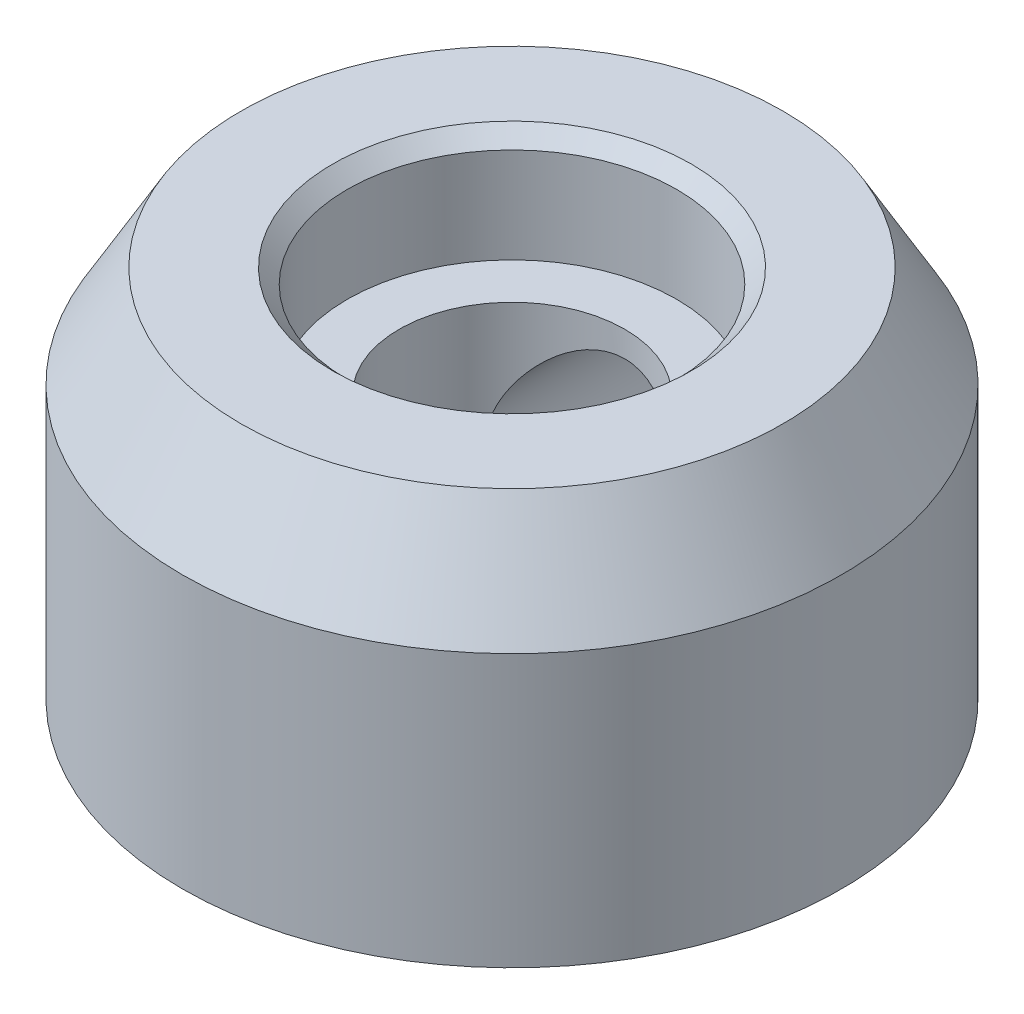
ISO-10303-21;
HEADER;
FILE_DESCRIPTION(('STEP AP214'),'2;1');
FILE_NAME('part.step','',(''),(''),'','','');
FILE_SCHEMA(('AUTOMOTIVE_DESIGN { 1 0 10303 214 1 1 1 1 }'));
ENDSEC;
DATA;
#1=APPLICATION_CONTEXT('core data for automotive mechanical design processes');
#2=APPLICATION_PROTOCOL_DEFINITION('international standard','automotive_design',2000,#1);
#3=PRODUCT_CONTEXT('',#1,'mechanical');
#4=PRODUCT('Part','Part','',(#3));
#5=PRODUCT_RELATED_PRODUCT_CATEGORY('part','',(#4));
#6=PRODUCT_DEFINITION_FORMATION('','',#4);
#7=PRODUCT_DEFINITION_CONTEXT('part definition',#1,'design');
#8=PRODUCT_DEFINITION('design','',#6,#7);
#9=PRODUCT_DEFINITION_SHAPE('','',#8);
#10=(LENGTH_UNIT() NAMED_UNIT(*) SI_UNIT(.MILLI.,.METRE.));
#11=(NAMED_UNIT(*) PLANE_ANGLE_UNIT() SI_UNIT($,.RADIAN.));
#12=(NAMED_UNIT(*) SI_UNIT($,.STERADIAN.) SOLID_ANGLE_UNIT());
#13=UNCERTAINTY_MEASURE_WITH_UNIT(LENGTH_MEASURE(1.E-05),#10,'distance_accuracy_value','');
#14=(GEOMETRIC_REPRESENTATION_CONTEXT(3) GLOBAL_UNCERTAINTY_ASSIGNED_CONTEXT((#13)) GLOBAL_UNIT_ASSIGNED_CONTEXT((#10,
#11,#12)) REPRESENTATION_CONTEXT('',''));
#15=CARTESIAN_POINT('',(0.,0.,0.));
#16=DIRECTION('',(0.,0.,1.));
#17=DIRECTION('',(1.,0.,0.));
#18=AXIS2_PLACEMENT_3D('',#15,#16,#17);
#19=CARTESIAN_POINT('',(0.,0.,0.));
#20=DIRECTION('',(0.,-1.,0.));
#21=DIRECTION('',(0.,0.,-1.));
#22=AXIS2_PLACEMENT_3D('',#19,#20,#21);
#23=CYLINDRICAL_SURFACE('',#22,7.1374);
#24=CARTESIAN_POINT('',(0.,16.8275,0.));
#25=DIRECTION('',(0.,1.,0.));
#26=DIRECTION('',(0.,0.,1.));
#27=AXIS2_PLACEMENT_3D('',#24,#25,#26);
#28=CIRCLE('',#27,7.1374);
#29=CARTESIAN_POINT('',(0.,16.8275,7.1374));
#30=VERTEX_POINT('',#29);
#31=EDGE_CURVE('E40',#30,#30,#28,.T.);
#32=ORIENTED_EDGE('',*,*,#31,.T.);
#33=EDGE_LOOP('',(#32));
#34=FACE_BOUND('',#33,.T.);
#35=CARTESIAN_POINT('',(0.,12.7,0.));
#36=DIRECTION('',(0.,-1.,0.));
#37=DIRECTION('',(0.,0.,-1.));
#38=AXIS2_PLACEMENT_3D('',#35,#36,#37);
#39=CIRCLE('',#38,7.1374);
#40=CARTESIAN_POINT('',(0.,12.7,-7.1374));
#41=VERTEX_POINT('',#40);
#42=EDGE_CURVE('E56',#41,#41,#39,.T.);
#43=ORIENTED_EDGE('',*,*,#42,.T.);
#44=EDGE_LOOP('',(#43));
#45=FACE_BOUND('',#44,.T.);
#46=ADVANCED_FACE('F30',(#34,#45),#23,.F.);
#47=CARTESIAN_POINT('',(4.8895,12.7,0.));
#48=DIRECTION('',(0.,1.,0.));
#49=DIRECTION('',(0.,0.,1.));
#50=AXIS2_PLACEMENT_3D('',#47,#48,#49);
#51=PLANE('',#50);
#52=CARTESIAN_POINT('',(0.,12.7,0.));
#53=DIRECTION('',(0.,-1.,0.));
#54=DIRECTION('',(0.,0.,-1.));
#55=AXIS2_PLACEMENT_3D('',#52,#53,#54);
#56=CIRCLE('',#55,4.8895);
#57=CARTESIAN_POINT('',(0.,12.7,-4.8895));
#58=VERTEX_POINT('',#57);
#59=EDGE_CURVE('E97',#58,#58,#56,.T.);
#60=ORIENTED_EDGE('',*,*,#59,.T.);
#61=EDGE_LOOP('',(#60));
#62=FACE_BOUND('',#61,.T.);
#63=ORIENTED_EDGE('',*,*,#42,.F.);
#64=EDGE_LOOP('',(#63));
#65=FACE_BOUND('',#64,.T.);
#66=ADVANCED_FACE('F85',(#62,#65),#51,.T.);
#67=CARTESIAN_POINT('',(0.,0.,0.));
#68=DIRECTION('',(0.,-1.,0.));
#69=DIRECTION('',(0.,0.,-1.));
#70=AXIS2_PLACEMENT_3D('',#67,#68,#69);
#71=CYLINDRICAL_SURFACE('',#70,4.8895);
#72=CARTESIAN_POINT('',(0.,11.58875,-4.8895));
#73=CARTESIAN_POINT('',(-0.0949550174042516,11.5887504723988,-4.88950046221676));
#74=CARTESIAN_POINT('',(-0.189904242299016,11.5853370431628,-4.88672853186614));
#75=CARTESIAN_POINT('',(-0.379031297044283,11.5717469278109,-4.87570729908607));
#76=CARTESIAN_POINT('',(-0.473208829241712,11.561567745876,-4.86745597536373));
#77=CARTESIAN_POINT('',(-0.660097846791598,11.5346095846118,-4.845651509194));
#78=CARTESIAN_POINT('',(-0.752807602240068,11.5178233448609,-4.83209253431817));
#79=CARTESIAN_POINT('',(-0.935992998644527,11.4779395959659,-4.79997855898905));
#80=CARTESIAN_POINT('',(-1.02646761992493,11.4548392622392,-4.78142132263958));
#81=CARTESIAN_POINT('',(-1.29242221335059,11.3769297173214,-4.71908577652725));
#82=CARTESIAN_POINT('',(-1.46381871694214,11.3133046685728,-4.66847341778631));
#83=CARTESIAN_POINT('',(-1.79205793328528,11.1656989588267,-4.55259529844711));
#84=CARTESIAN_POINT('',(-1.94889835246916,11.0817150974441,-4.48732723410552));
#85=CARTESIAN_POINT('',(-2.19854874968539,10.9262804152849,-4.36876211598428));
#86=CARTESIAN_POINT('',(-2.29572294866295,10.8594924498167,-4.31837093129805));
#87=CARTESIAN_POINT('',(-2.48249039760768,10.718692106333,-4.2137752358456));
#88=CARTESIAN_POINT('',(-2.57208362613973,10.6446797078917,-4.15957071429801));
#89=CARTESIAN_POINT('',(-2.74381452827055,10.4898205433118,-4.04835642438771));
#90=CARTESIAN_POINT('',(-2.82592982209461,10.4089545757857,-3.99133897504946));
#91=CARTESIAN_POINT('',(-2.98234386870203,10.2410235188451,-3.87585860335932));
#92=CARTESIAN_POINT('',(-3.05664557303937,10.1539607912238,-3.81739623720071));
#93=CARTESIAN_POINT('',(-3.19859878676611,9.97232900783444,-3.69930259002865));
#94=CARTESIAN_POINT('',(-3.26611802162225,9.8776586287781,-3.63966813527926));
#95=CARTESIAN_POINT('',(-3.39295924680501,9.68213259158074,-3.5217235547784));
#96=CARTESIAN_POINT('',(-3.45227856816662,9.58127493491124,-3.46341386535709));
#97=CARTESIAN_POINT('',(-3.56227954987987,9.37354413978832,-3.35016195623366));
#98=CARTESIAN_POINT('',(-3.61298363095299,9.26668760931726,-3.2952112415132));
#99=CARTESIAN_POINT('',(-3.70539881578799,9.04661430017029,-3.19093702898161));
#100=CARTESIAN_POINT('',(-3.74711765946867,8.9334031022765,-3.14160870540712));
#101=CARTESIAN_POINT('',(-3.82558637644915,8.68531654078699,-3.0457211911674));
#102=CARTESIAN_POINT('',(-3.86099214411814,8.54953472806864,-3.00034882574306));
#103=CARTESIAN_POINT('',(-3.91758843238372,8.2708420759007,-2.92607716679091));
#104=CARTESIAN_POINT('',(-3.93881438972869,8.12794997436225,-2.89713683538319));
#105=CARTESIAN_POINT('',(-3.9655664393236,7.83639148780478,-2.8604326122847));
#106=CARTESIAN_POINT('',(-3.97093606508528,7.68768213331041,-2.85287979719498));
#107=CARTESIAN_POINT('',(-3.96492918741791,7.39123096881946,-2.86121537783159));
#108=CARTESIAN_POINT('',(-3.95354213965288,7.24348982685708,-2.87711853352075));
#109=CARTESIAN_POINT('',(-3.91260813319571,6.93444331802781,-2.93257383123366));
#110=CARTESIAN_POINT('',(-3.88082697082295,6.7739822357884,-2.97501610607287));
#111=CARTESIAN_POINT('',(-3.79987132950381,6.46332439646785,-3.07772825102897));
#112=CARTESIAN_POINT('',(-3.75064331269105,6.31316095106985,-3.13805290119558));
#113=CARTESIAN_POINT('',(-3.6503749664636,6.05800805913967,-3.25367391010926));
#114=CARTESIAN_POINT('',(-3.60250841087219,5.95072543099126,-3.3067931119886));
#115=CARTESIAN_POINT('',(-3.49837763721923,5.74225841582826,-3.41676683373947));
#116=CARTESIAN_POINT('',(-3.44210918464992,5.64107714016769,-3.47362322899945));
#117=CARTESIAN_POINT('',(-3.32144008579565,5.44461093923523,-3.5891837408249));
#118=CARTESIAN_POINT('',(-3.25702941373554,5.34933350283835,-3.64789006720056));
#119=CARTESIAN_POINT('',(-3.12029236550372,5.16481491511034,-3.76551724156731));
#120=CARTESIAN_POINT('',(-3.0479673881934,5.07557270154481,-3.82443804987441));
#121=CARTESIAN_POINT('',(-2.8928398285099,4.90032896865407,-3.94316527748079));
#122=CARTESIAN_POINT('',(-2.80976323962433,4.81454311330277,-4.00293291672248));
#123=CARTESIAN_POINT('',(-2.63523263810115,4.64999793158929,-4.1199274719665));
#124=CARTESIAN_POINT('',(-2.54377736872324,4.57123966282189,-4.17715400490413));
#125=CARTESIAN_POINT('',(-2.35280424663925,4.42156937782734,-4.28761590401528));
#126=CARTESIAN_POINT('',(-2.25330618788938,4.35063905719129,-4.34086048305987));
#127=CARTESIAN_POINT('',(-2.04634017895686,4.21725877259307,-4.44218466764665));
#128=CARTESIAN_POINT('',(-1.93887233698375,4.1548086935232,-4.4902643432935));
#129=CARTESIAN_POINT('',(-1.66698247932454,4.01378907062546,-4.59980690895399));
#130=CARTESIAN_POINT('',(-1.49838528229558,3.94029852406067,-4.65778968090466));
#131=CARTESIAN_POINT('',(-1.23585961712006,3.84743015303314,-4.73161439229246));
#132=CARTESIAN_POINT('',(-1.14672591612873,3.81936444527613,-4.75403445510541));
#133=CARTESIAN_POINT('',(-0.965711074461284,3.76939276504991,-4.79407797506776));
#134=CARTESIAN_POINT('',(-0.8738312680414,3.7474838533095,-4.81170372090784));
#135=CARTESIAN_POINT('',(-0.687318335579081,3.71005390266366,-4.84187868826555));
#136=CARTESIAN_POINT('',(-0.592671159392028,3.69457546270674,-4.85439404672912));
#137=CARTESIAN_POINT('',(-0.401981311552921,3.67049134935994,-4.87388984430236));
#138=CARTESIAN_POINT('',(-0.305939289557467,3.66188257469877,-4.88087278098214));
#139=CARTESIAN_POINT('',(-0.113230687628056,3.65169308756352,-4.88913937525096));
#140=CARTESIAN_POINT('',(-0.0165641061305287,3.65011239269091,-4.8904230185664));
#141=CARTESIAN_POINT('',(0.176503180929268,3.65399914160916,-4.88726896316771));
#142=CARTESIAN_POINT('',(0.272903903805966,3.65946611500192,-4.88283164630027));
#143=CARTESIAN_POINT('',(0.5425276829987,3.6846486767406,-4.86241866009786));
#144=CARTESIAN_POINT('',(0.714616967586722,3.71232630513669,-4.84000216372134));
#145=CARTESIAN_POINT('',(1.05068220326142,3.78896416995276,-4.77834280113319));
#146=CARTESIAN_POINT('',(1.21465711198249,3.83792713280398,-4.73909777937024));
#147=CARTESIAN_POINT('',(1.53885145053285,3.95746676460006,-4.64424340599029));
#148=CARTESIAN_POINT('',(1.69853215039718,4.02895112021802,-4.58795162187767));
#149=CARTESIAN_POINT('',(2.00352842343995,4.18974887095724,-4.46321341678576));
#150=CARTESIAN_POINT('',(2.14883453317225,4.2790738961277,-4.39475907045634));
#151=CARTESIAN_POINT('',(2.3861492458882,4.44633051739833,-4.26922242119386));
#152=CARTESIAN_POINT('',(2.48183806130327,4.52065738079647,-4.21417763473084));
#153=CARTESIAN_POINT('',(2.66496270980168,4.6766322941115,-4.10082584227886));
#154=CARTESIAN_POINT('',(2.75239846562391,4.75828041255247,-4.04251880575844));
#155=CARTESIAN_POINT('',(2.91912763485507,4.92854949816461,-3.92382494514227));
#156=CARTESIAN_POINT('',(2.99840179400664,5.01718612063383,-3.86343363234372));
#157=CARTESIAN_POINT('',(3.14852280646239,5.20093930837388,-3.74210112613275));
#158=CARTESIAN_POINT('',(3.21937163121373,5.29605434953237,-3.68116006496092));
#159=CARTESIAN_POINT('',(3.34287286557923,5.47839401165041,-3.56907841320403));
#160=CARTESIAN_POINT('',(3.39667359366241,5.56475824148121,-3.51779992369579));
#161=CARTESIAN_POINT('',(3.49791502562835,5.7422334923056,-3.41714699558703));
#162=CARTESIAN_POINT('',(3.54535484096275,5.83334517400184,-3.36777282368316));
#163=CARTESIAN_POINT('',(3.63349458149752,6.02020723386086,-3.27248033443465));
#164=CARTESIAN_POINT('',(3.67421060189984,6.11594580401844,-3.22655391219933));
#165=CARTESIAN_POINT('',(3.748591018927,6.31230699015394,-3.139831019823));
#166=CARTESIAN_POINT('',(3.78225955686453,6.41292669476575,-3.09903154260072));
#167=CARTESIAN_POINT('',(3.85022832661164,6.64764500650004,-3.01440802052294));
#168=CARTESIAN_POINT('',(3.88213002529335,6.78330896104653,-2.97286598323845));
#169=CARTESIAN_POINT('',(3.93172245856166,7.06112091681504,-2.9069767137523));
#170=CARTESIAN_POINT('',(3.94944632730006,7.20325297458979,-2.88258940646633));
#171=CARTESIAN_POINT('',(3.96933540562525,7.49195119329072,-2.85515733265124));
#172=CARTESIAN_POINT('',(3.97137407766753,7.63854385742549,-2.85228614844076));
#173=CARTESIAN_POINT('',(3.95933095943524,7.92982176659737,-2.8689688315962));
#174=CARTESIAN_POINT('',(3.94523223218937,8.07450484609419,-2.88854625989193));
#175=CARTESIAN_POINT('',(3.89809734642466,8.38486558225,-2.95192044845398));
#176=CARTESIAN_POINT('',(3.86193881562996,8.54922491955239,-2.99965317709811));
#177=CARTESIAN_POINT('',(3.77148863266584,8.86670995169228,-3.11259894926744));
#178=CARTESIAN_POINT('',(3.71714099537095,9.01979916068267,-3.17786583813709));
#179=CARTESIAN_POINT('',(3.60756210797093,9.27865526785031,-3.30118179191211));
#180=CARTESIAN_POINT('',(3.55572755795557,9.3869085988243,-3.35715523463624));
#181=CARTESIAN_POINT('',(3.44332742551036,9.59703792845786,-3.47234477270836));
#182=CARTESIAN_POINT('',(3.38275767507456,9.69891084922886,-3.5315624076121));
#183=CARTESIAN_POINT('',(3.25311338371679,9.89644465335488,-3.65133786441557));
#184=CARTESIAN_POINT('',(3.18402920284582,9.99209830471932,-3.71189714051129));
#185=CARTESIAN_POINT('',(3.0375422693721,10.1769943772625,-3.83269624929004));
#186=CARTESIAN_POINT('',(2.96014097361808,10.2662379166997,-3.89293613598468));
#187=CARTESIAN_POINT('',(2.79498111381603,10.4402495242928,-4.0132271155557));
#188=CARTESIAN_POINT('',(2.70700909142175,10.5248458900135,-4.07323438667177));
#189=CARTESIAN_POINT('',(2.52240245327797,10.6865158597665,-4.19006373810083));
#190=CARTESIAN_POINT('',(2.42576639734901,10.7635882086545,-4.24688528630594));
#191=CARTESIAN_POINT('',(2.2241982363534,10.9092754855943,-4.35582765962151));
#192=CARTESIAN_POINT('',(2.1192852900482,10.9779090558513,-4.40795877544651));
#193=CARTESIAN_POINT('',(1.90141778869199,11.1059095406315,-4.50623146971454));
#194=CARTESIAN_POINT('',(1.78846755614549,11.1652813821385,-4.55237623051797));
#195=CARTESIAN_POINT('',(1.50969843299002,11.2947205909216,-4.65377302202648));
#196=CARTESIAN_POINT('',(1.34032883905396,11.3600421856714,-4.70564388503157));
#197=CARTESIAN_POINT('',(1.07800668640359,11.4406374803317,-4.77003708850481));
#198=CARTESIAN_POINT('',(0.989241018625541,11.4645960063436,-4.78925882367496));
#199=CARTESIAN_POINT('',(0.809401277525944,11.5064318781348,-4.82290674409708));
#200=CARTESIAN_POINT('',(0.718327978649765,11.5243112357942,-4.83733451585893));
#201=CARTESIAN_POINT('',(0.523452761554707,11.5554599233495,-4.86250803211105));
#202=CARTESIAN_POINT('',(0.419435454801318,11.567918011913,-4.87260371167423));
#203=CARTESIAN_POINT('',(0.21027658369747,11.5845638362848,-4.88610028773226));
#204=CARTESIAN_POINT('',(0.105134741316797,11.5887494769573,-4.88949948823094));
#205=CARTESIAN_POINT('',(0.,11.58875,-4.8895));
#206=B_SPLINE_CURVE_WITH_KNOTS('',3,(#72,#73,#74,#75,#76,#77,#78,#79,#80,#81,#82,#83,#84,#85,
#86,#87,#88,#89,#90,#91,#92,#93,#94,#95,#96,#97,#98,#99,#100,#101,#102,#103,#104,#105,#106,#107,
#108,#109,#110,#111,#112,#113,#114,#115,#116,#117,#118,#119,#120,#121,#122,#123,#124,#125,#126,
#127,#128,#129,#130,#131,#132,#133,#134,#135,#136,#137,#138,#139,#140,#141,#142,#143,#144,#145,
#146,#147,#148,#149,#150,#151,#152,#153,#154,#155,#156,#157,#158,#159,#160,#161,#162,#163,#164,
#165,#166,#167,#168,#169,#170,#171,#172,#173,#174,#175,#176,#177,#178,#179,#180,#181,#182,#183,
#184,#185,#186,#187,#188,#189,#190,#191,#192,#193,#194,#195,#196,#197,#198,#199,#200,#201,#202,
#203,#204,#205),.UNSPECIFIED.,.T.,.F.,(4,2,2,2,2,2,2,2,2,2,2,2,2,2,2,2,2,2,2,2,2,2,2,2,2,2,2,2,
2,2,2,2,2,2,2,2,2,2,2,2,2,2,2,2,2,2,2,2,2,2,2,2,2,2,2,2,2,2,2,2,2,2,2,2,2,2,4),(0.,
0.284753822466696,0.569612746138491,0.854785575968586,1.14008618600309,1.70650884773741,
2.27302060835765,2.65724227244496,3.04146502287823,3.42680226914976,3.8119934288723,
4.20363812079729,4.59540998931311,4.98614613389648,5.37654433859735,5.81752357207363,
6.25739659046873,6.70159590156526,7.14607484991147,7.65026821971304,8.15602236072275,
8.54233244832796,8.9288378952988,9.31582398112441,9.70274177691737,10.1029108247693,
10.503139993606,10.9024125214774,11.3016796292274,11.8774565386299,12.1654686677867,
12.4533430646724,12.7430952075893,13.0327164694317,13.3223384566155,13.6119411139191,
14.1365276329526,14.661181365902,15.2104938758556,15.7601656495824,16.1589296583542,
16.5576973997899,16.9573853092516,17.3569795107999,17.6985371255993,18.0401424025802,
18.3809177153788,18.7214922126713,19.156219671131,19.5899281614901,20.0271318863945,
20.4647948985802,20.9866873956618,21.5102012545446,21.9070237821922,22.30403628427,
22.7015024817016,23.0988991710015,23.5064095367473,23.9139877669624,24.3206487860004,
24.7270927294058,25.2907483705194,25.5722550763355,25.8536685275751,26.1688697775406,
26.4841508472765),.UNSPECIFIED.);
#207=CARTESIAN_POINT('',(0.,11.58875,-4.8895));
#208=VERTEX_POINT('',#207);
#209=EDGE_CURVE('E72',#208,#208,#206,.T.);
#210=ORIENTED_EDGE('',*,*,#209,.F.);
#211=EDGE_LOOP('',(#210));
#212=FACE_BOUND('',#211,.T.);
#213=CARTESIAN_POINT('',(0.,0.,0.));
#214=DIRECTION('',(0.,-1.,0.));
#215=DIRECTION('',(0.,0.,-1.));
#216=AXIS2_PLACEMENT_3D('',#213,#214,#215);
#217=CIRCLE('',#216,4.8895);
#218=CARTESIAN_POINT('',(0.,0.,-4.8895));
#219=VERTEX_POINT('',#218);
#220=EDGE_CURVE('E101',#219,#219,#217,.T.);
#221=ORIENTED_EDGE('',*,*,#220,.T.);
#222=EDGE_LOOP('',(#221));
#223=FACE_BOUND('',#222,.T.);
#224=ORIENTED_EDGE('',*,*,#59,.F.);
#225=EDGE_LOOP('',(#224));
#226=FACE_BOUND('',#225,.T.);
#227=ADVANCED_FACE('F80',(#212,#223,#226),#71,.F.);
#228=CARTESIAN_POINT('',(4.8895,0.,0.));
#229=DIRECTION('',(0.,-1.,0.));
#230=DIRECTION('',(0.,0.,-1.));
#231=AXIS2_PLACEMENT_3D('',#228,#229,#230);
#232=PLANE('',#231);
#233=CARTESIAN_POINT('',(0.,0.,0.));
#234=DIRECTION('',(0.,-1.,0.));
#235=DIRECTION('',(0.,0.,-1.));
#236=AXIS2_PLACEMENT_3D('',#233,#234,#235);
#237=CIRCLE('',#236,6.2103);
#238=CARTESIAN_POINT('',(0.,0.,-6.2103));
#239=VERTEX_POINT('',#238);
#240=EDGE_CURVE('E103',#239,#239,#237,.T.);
#241=ORIENTED_EDGE('',*,*,#240,.T.);
#242=EDGE_LOOP('',(#241));
#243=FACE_BOUND('',#242,.T.);
#244=ORIENTED_EDGE('',*,*,#220,.F.);
#245=EDGE_LOOP('',(#244));
#246=FACE_BOUND('',#245,.T.);
#247=ADVANCED_FACE('F84',(#243,#246),#232,.T.);
#248=CARTESIAN_POINT('',(0.,0.,0.));
#249=DIRECTION('',(0.,-1.,0.));
#250=DIRECTION('',(0.,0.,-1.));
#251=AXIS2_PLACEMENT_3D('',#248,#249,#250);
#252=CYLINDRICAL_SURFACE('',#251,6.2103);
#253=CARTESIAN_POINT('',(0.,1.27,0.));
#254=DIRECTION('',(0.,-1.,0.));
#255=DIRECTION('',(0.,0.,-1.));
#256=AXIS2_PLACEMENT_3D('',#253,#254,#255);
#257=CIRCLE('',#256,6.2103);
#258=CARTESIAN_POINT('',(0.,1.27,-6.2103));
#259=VERTEX_POINT('',#258);
#260=EDGE_CURVE('E108',#259,#259,#257,.T.);
#261=ORIENTED_EDGE('',*,*,#260,.T.);
#262=EDGE_LOOP('',(#261));
#263=FACE_BOUND('',#262,.T.);
#264=ORIENTED_EDGE('',*,*,#240,.F.);
#265=EDGE_LOOP('',(#264));
#266=FACE_BOUND('',#265,.T.);
#267=ADVANCED_FACE('F153',(#263,#266),#252,.T.);
#268=CARTESIAN_POINT('',(6.2103,1.27,0.));
#269=DIRECTION('',(0.,-1.,0.));
#270=DIRECTION('',(0.,0.,-1.));
#271=AXIS2_PLACEMENT_3D('',#268,#269,#270);
#272=PLANE('',#271);
#273=CARTESIAN_POINT('',(0.,1.27,0.));
#274=DIRECTION('',(0.,-1.,0.));
#275=DIRECTION('',(0.,0.,-1.));
#276=AXIS2_PLACEMENT_3D('',#273,#274,#275);
#277=CIRCLE('',#276,8.3947);
#278=CARTESIAN_POINT('',(0.,1.27,-8.3947));
#279=VERTEX_POINT('',#278);
#280=EDGE_CURVE('E111',#279,#279,#277,.T.);
#281=ORIENTED_EDGE('',*,*,#280,.T.);
#282=EDGE_LOOP('',(#281));
#283=FACE_BOUND('',#282,.T.);
#284=ORIENTED_EDGE('',*,*,#260,.F.);
#285=EDGE_LOOP('',(#284));
#286=FACE_BOUND('',#285,.T.);
#287=ADVANCED_FACE('F150',(#283,#286),#272,.T.);
#288=CARTESIAN_POINT('',(0.,0.,0.));
#289=DIRECTION('',(0.,-1.,0.));
#290=DIRECTION('',(0.,0.,-1.));
#291=AXIS2_PLACEMENT_3D('',#288,#289,#290);
#292=CYLINDRICAL_SURFACE('',#291,8.3947);
#293=CARTESIAN_POINT('',(0.,0.,0.));
#294=DIRECTION('',(0.,-1.,0.));
#295=DIRECTION('',(0.,0.,-1.));
#296=AXIS2_PLACEMENT_3D('',#293,#294,#295);
#297=CIRCLE('',#296,8.3947);
#298=CARTESIAN_POINT('',(0.,0.,-8.3947));
#299=VERTEX_POINT('',#298);
#300=EDGE_CURVE('E114',#299,#299,#297,.T.);
#301=ORIENTED_EDGE('',*,*,#300,.T.);
#302=EDGE_LOOP('',(#301));
#303=FACE_BOUND('',#302,.T.);
#304=ORIENTED_EDGE('',*,*,#280,.F.);
#305=EDGE_LOOP('',(#304));
#306=FACE_BOUND('',#305,.T.);
#307=ADVANCED_FACE('F146',(#303,#306),#292,.F.);
#308=CARTESIAN_POINT('',(8.3947,0.,0.));
#309=DIRECTION('',(0.,-1.,0.));
#310=DIRECTION('',(0.,0.,-1.));
#311=AXIS2_PLACEMENT_3D('',#308,#309,#310);
#312=PLANE('',#311);
#313=CARTESIAN_POINT('',(0.,0.,0.));
#314=DIRECTION('',(0.,-1.,0.));
#315=DIRECTION('',(0.,0.,-1.));
#316=AXIS2_PLACEMENT_3D('',#313,#314,#315);
#317=CIRCLE('',#316,11.1633);
#318=CARTESIAN_POINT('',(0.,0.,-11.1633));
#319=VERTEX_POINT('',#318);
#320=EDGE_CURVE('E117',#319,#319,#317,.T.);
#321=ORIENTED_EDGE('',*,*,#320,.T.);
#322=EDGE_LOOP('',(#321));
#323=FACE_BOUND('',#322,.T.);
#324=ORIENTED_EDGE('',*,*,#300,.F.);
#325=EDGE_LOOP('',(#324));
#326=FACE_BOUND('',#325,.T.);
#327=ADVANCED_FACE('F141',(#323,#326),#312,.T.);
#328=CARTESIAN_POINT('',(0.,0.,0.));
#329=DIRECTION('',(0.,-1.,0.));
#330=DIRECTION('',(0.,0.,-1.));
#331=AXIS2_PLACEMENT_3D('',#328,#329,#330);
#332=CYLINDRICAL_SURFACE('',#331,11.1633);
#333=CARTESIAN_POINT('',(0.,1.27,0.));
#334=DIRECTION('',(0.,-1.,0.));
#335=DIRECTION('',(0.,0.,-1.));
#336=AXIS2_PLACEMENT_3D('',#333,#334,#335);
#337=CIRCLE('',#336,11.1633);
#338=CARTESIAN_POINT('',(0.,1.27,-11.1633));
#339=VERTEX_POINT('',#338);
#340=EDGE_CURVE('E119',#339,#339,#337,.T.);
#341=ORIENTED_EDGE('',*,*,#340,.T.);
#342=EDGE_LOOP('',(#341));
#343=FACE_BOUND('',#342,.T.);
#344=ORIENTED_EDGE('',*,*,#320,.F.);
#345=EDGE_LOOP('',(#344));
#346=FACE_BOUND('',#345,.T.);
#347=ADVANCED_FACE('F134',(#343,#346),#332,.T.);
#348=CARTESIAN_POINT('',(11.1633,1.27,0.));
#349=DIRECTION('',(0.,-1.,0.));
#350=DIRECTION('',(0.,0.,-1.));
#351=AXIS2_PLACEMENT_3D('',#348,#349,#350);
#352=PLANE('',#351);
#353=CARTESIAN_POINT('',(0.,1.27,0.));
#354=DIRECTION('',(0.,-1.,0.));
#355=DIRECTION('',(0.,0.,-1.));
#356=AXIS2_PLACEMENT_3D('',#353,#354,#355);
#357=CIRCLE('',#356,14.2875);
#358=CARTESIAN_POINT('',(0.,1.27,-14.2875));
#359=VERTEX_POINT('',#358);
#360=EDGE_CURVE('E78',#359,#359,#357,.T.);
#361=ORIENTED_EDGE('',*,*,#360,.T.);
#362=EDGE_LOOP('',(#361));
#363=FACE_BOUND('',#362,.T.);
#364=ORIENTED_EDGE('',*,*,#340,.F.);
#365=EDGE_LOOP('',(#364));
#366=FACE_BOUND('',#365,.T.);
#367=ADVANCED_FACE('F126',(#363,#366),#352,.T.);
#368=CARTESIAN_POINT('',(0.,0.,0.));
#369=DIRECTION('',(0.,-1.,0.));
#370=DIRECTION('',(0.,0.,-1.));
#371=AXIS2_PLACEMENT_3D('',#368,#369,#370);
#372=CYLINDRICAL_SURFACE('',#371,14.2875);
#373=CARTESIAN_POINT('',(0.,13.0630909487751,0.));
#374=DIRECTION('',(0.,1.,0.));
#375=DIRECTION('',(0.,0.,1.));
#376=AXIS2_PLACEMENT_3D('',#373,#374,#375);
#377=CIRCLE('',#376,14.2875);
#378=CARTESIAN_POINT('',(0.,13.0630909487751,14.2875));
#379=VERTEX_POINT('',#378);
#380=EDGE_CURVE('E36',#379,#379,#377,.F.);
#381=ORIENTED_EDGE('',*,*,#380,.T.);
#382=EDGE_LOOP('',(#381));
#383=FACE_BOUND('',#382,.T.);
#384=CARTESIAN_POINT('',(0.,11.58875,-14.2875));
#385=CARTESIAN_POINT('',(0.218443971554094,11.5887455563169,-14.2874970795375));
#386=CARTESIAN_POINT('',(0.436934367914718,11.5706546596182,-14.2824414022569));
#387=CARTESIAN_POINT('',(0.867598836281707,11.4989110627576,-14.2627651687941));
#388=CARTESIAN_POINT('',(1.07977020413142,11.4452433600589,-14.2481405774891));
#389=CARTESIAN_POINT('',(1.49151959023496,11.3042423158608,-14.2109369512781));
#390=CARTESIAN_POINT('',(1.69111418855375,11.2169544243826,-14.188368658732));
#391=CARTESIAN_POINT('',(2.07283270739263,11.0113651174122,-14.1376499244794));
#392=CARTESIAN_POINT('',(2.25495507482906,10.8930609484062,-14.1094989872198));
#393=CARTESIAN_POINT('',(2.60110854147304,10.625679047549,-14.0498562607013));
#394=CARTESIAN_POINT('',(2.76464113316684,10.4759695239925,-14.0183036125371));
#395=CARTESIAN_POINT('',(3.06463123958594,10.1513758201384,-13.9557952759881));
#396=CARTESIAN_POINT('',(3.20108494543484,9.97648810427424,-13.9248396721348));
#397=CARTESIAN_POINT('',(3.44553567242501,9.60244694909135,-13.8664011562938));
#398=CARTESIAN_POINT('',(3.55294802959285,9.40289836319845,-13.8389946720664));
#399=CARTESIAN_POINT('',(3.73249688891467,8.98768866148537,-13.7916571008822));
#400=CARTESIAN_POINT('',(3.80464051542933,8.77203080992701,-13.7717245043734));
#401=CARTESIAN_POINT('',(3.9098513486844,8.33627114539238,-13.7422217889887));
#402=CARTESIAN_POINT('',(3.94382742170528,8.11640546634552,-13.7324111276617));
#403=CARTESIAN_POINT('',(3.97457380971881,7.67389281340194,-13.7235453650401));
#404=CARTESIAN_POINT('',(3.97135172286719,7.45124641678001,-13.7244880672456));
#405=CARTESIAN_POINT('',(3.92851231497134,7.01667926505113,-13.7368078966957));
#406=CARTESIAN_POINT('',(3.89000689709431,6.80463840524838,-13.7478662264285));
#407=CARTESIAN_POINT('',(3.77947971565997,6.39015222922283,-13.7786591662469));
#408=CARTESIAN_POINT('',(3.70745507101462,6.18770773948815,-13.7983945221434));
#409=CARTESIAN_POINT('',(3.53105634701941,5.79532041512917,-13.8445897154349));
#410=CARTESIAN_POINT('',(3.4263019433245,5.60555817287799,-13.871127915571));
#411=CARTESIAN_POINT('',(3.18768224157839,5.24592049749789,-13.9278979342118));
#412=CARTESIAN_POINT('',(3.05381077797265,5.07604928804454,-13.958130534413));
#413=CARTESIAN_POINT('',(2.75512406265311,4.75467717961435,-14.0201990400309));
#414=CARTESIAN_POINT('',(2.58937848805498,4.60404325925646,-14.052053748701));
#415=CARTESIAN_POINT('',(2.23458597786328,4.33252330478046,-14.1128178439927));
#416=CARTESIAN_POINT('',(2.04553796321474,4.21163864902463,-14.1417270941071));
#417=CARTESIAN_POINT('',(1.64808988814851,4.00262148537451,-14.1935466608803));
#418=CARTESIAN_POINT('',(1.4395970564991,3.91465719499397,-14.2164259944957));
#419=CARTESIAN_POINT('',(1.00999921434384,3.77528423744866,-14.2533843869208));
#420=CARTESIAN_POINT('',(0.788897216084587,3.7238668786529,-14.2674655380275));
#421=CARTESIAN_POINT('',(0.347746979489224,3.66043484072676,-14.2849198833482));
#422=CARTESIAN_POINT('',(0.127880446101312,3.64724268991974,-14.2886129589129));
#423=CARTESIAN_POINT('',(-0.310927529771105,3.65736821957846,-14.2858007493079));
#424=CARTESIAN_POINT('',(-0.529869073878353,3.68068177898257,-14.2792966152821));
#425=CARTESIAN_POINT('',(-0.956331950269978,3.76219508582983,-14.2570284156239));
#426=CARTESIAN_POINT('',(-1.16399083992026,3.81972802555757,-14.2414414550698));
#427=CARTESIAN_POINT('',(-1.56668190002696,3.96726367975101,-14.2027855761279));
#428=CARTESIAN_POINT('',(-1.76171264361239,4.0572700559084,-14.1797158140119));
#429=CARTESIAN_POINT('',(-2.13810894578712,4.26931416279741,-14.1279162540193));
#430=CARTESIAN_POINT('',(-2.31910592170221,4.39197916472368,-14.0990787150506));
#431=CARTESIAN_POINT('',(-2.65835660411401,4.66507873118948,-14.0390713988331));
#432=CARTESIAN_POINT('',(-2.81660541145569,4.81551926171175,-14.007901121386));
#433=CARTESIAN_POINT('',(-3.11090318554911,5.14540958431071,-13.9455475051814));
#434=CARTESIAN_POINT('',(-3.24611866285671,5.32560990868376,-13.9143933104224));
#435=CARTESIAN_POINT('',(-3.4844222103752,5.70681052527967,-13.8566427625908));
#436=CARTESIAN_POINT('',(-3.58751150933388,5.90781002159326,-13.8300462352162));
#437=CARTESIAN_POINT('',(-3.75786986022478,6.32398776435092,-13.784732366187));
#438=CARTESIAN_POINT('',(-3.82533771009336,6.53907962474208,-13.7659714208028));
#439=CARTESIAN_POINT('',(-3.9229554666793,6.97817282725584,-13.738475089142));
#440=CARTESIAN_POINT('',(-3.95311591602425,7.20217163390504,-13.7297368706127));
#441=CARTESIAN_POINT('',(-3.9746193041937,7.64414834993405,-13.7235259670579));
#442=CARTESIAN_POINT('',(-3.96730762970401,7.86205625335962,-13.7256628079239));
#443=CARTESIAN_POINT('',(-3.91722429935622,8.29340128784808,-13.740039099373));
#444=CARTESIAN_POINT('',(-3.87445370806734,8.50683855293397,-13.7522782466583));
#445=CARTESIAN_POINT('',(-3.75547649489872,8.92132846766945,-13.7852378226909));
#446=CARTESIAN_POINT('',(-3.67957781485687,9.12247617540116,-13.8058800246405));
#447=CARTESIAN_POINT('',(-3.49673709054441,9.50933906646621,-13.8533160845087));
#448=CARTESIAN_POINT('',(-3.38978980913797,9.69505163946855,-13.8801109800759));
#449=CARTESIAN_POINT('',(-3.14390710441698,10.0521377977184,-13.9378947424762));
#450=CARTESIAN_POINT('',(-3.0040646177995,10.2228696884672,-13.9689896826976));
#451=CARTESIAN_POINT('',(-2.69805634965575,10.5388802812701,-14.0313039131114));
#452=CARTESIAN_POINT('',(-2.53188405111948,10.684152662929,-14.0625232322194));
#453=CARTESIAN_POINT('',(-2.17316123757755,10.9485370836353,-14.1224584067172));
#454=CARTESIAN_POINT('',(-1.98007687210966,11.0669439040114,-14.1510969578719));
#455=CARTESIAN_POINT('',(-1.57594929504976,11.2694343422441,-14.2017742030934));
#456=CARTESIAN_POINT('',(-1.3649167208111,11.3535381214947,-14.2238167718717));
#457=CARTESIAN_POINT('',(-0.962486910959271,11.4751487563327,-14.2562603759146));
#458=CARTESIAN_POINT('',(-0.77268197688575,11.5176452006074,-14.2678862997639));
#459=CARTESIAN_POINT('',(-0.388596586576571,11.5744461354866,-14.283506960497));
#460=CARTESIAN_POINT('',(-0.194316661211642,11.5887539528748,-14.2875025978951));
#461=CARTESIAN_POINT('',(0.,11.58875,-14.2875));
#462=B_SPLINE_CURVE_WITH_KNOTS('',3,(#384,#385,#386,#387,#388,#389,#390,#391,#392,#393,#394,
#395,#396,#397,#398,#399,#400,#401,#402,#403,#404,#405,#406,#407,#408,#409,#410,#411,#412,#413,
#414,#415,#416,#417,#418,#419,#420,#421,#422,#423,#424,#425,#426,#427,#428,#429,#430,#431,#432,
#433,#434,#435,#436,#437,#438,#439,#440,#441,#442,#443,#444,#445,#446,#447,#448,#449,#450,#451,
#452,#453,#454,#455,#456,#457,#458,#459,#460,#461),.UNSPECIFIED.,.T.,.F.,(4,2,2,2,2,2,2,2,2,2,2,
2,2,2,2,2,2,2,2,2,2,2,2,2,2,2,2,2,2,2,2,2,2,2,2,2,2,2,4),(0.,0.654618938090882,1.30951410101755,
1.96352702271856,2.61759802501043,3.28636707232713,3.95523012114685,4.63669666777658,
5.31802549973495,5.98276146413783,6.6473616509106,7.2917123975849,7.93611853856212,
8.58831023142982,9.24064016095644,9.91614392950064,10.5916789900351,11.2706202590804,
11.9494000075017,12.6070363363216,13.2645984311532,13.9097485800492,14.5549714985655,
15.2136141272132,15.8723983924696,16.5514652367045,17.2305061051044,17.9057161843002,
18.5807354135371,19.2316925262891,19.8826300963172,20.5276416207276,21.1727620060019,
21.838345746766,22.5040944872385,23.1856943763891,23.8668930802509,24.4492775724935,
25.0315933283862),.UNSPECIFIED.);
#463=CARTESIAN_POINT('',(0.,11.58875,-14.2875));
#464=VERTEX_POINT('',#463);
#465=EDGE_CURVE('E49',#464,#464,#462,.T.);
#466=ORIENTED_EDGE('',*,*,#465,.F.);
#467=EDGE_LOOP('',(#466));
#468=FACE_BOUND('',#467,.T.);
#469=ORIENTED_EDGE('',*,*,#360,.F.);
#470=EDGE_LOOP('',(#469));
#471=FACE_BOUND('',#470,.T.);
#472=ADVANCED_FACE('F58',(#383,#468,#471),#372,.T.);
#473=CARTESIAN_POINT('',(14.2875,17.4625,0.));
#474=DIRECTION('',(0.,1.,0.));
#475=DIRECTION('',(0.,0.,1.));
#476=AXIS2_PLACEMENT_3D('',#473,#474,#475);
#477=PLANE('',#476);
#478=CARTESIAN_POINT('',(0.,17.4625,0.));
#479=DIRECTION('',(0.,1.,0.));
#480=DIRECTION('',(0.,0.,1.));
#481=AXIS2_PLACEMENT_3D('',#478,#479,#480);
#482=CIRCLE('',#481,11.7475);
#483=CARTESIAN_POINT('',(0.,17.4625,11.7475));
#484=VERTEX_POINT('',#483);
#485=EDGE_CURVE('E10',#484,#484,#482,.T.);
#486=ORIENTED_EDGE('',*,*,#485,.T.);
#487=EDGE_LOOP('',(#486));
#488=FACE_BOUND('',#487,.T.);
#489=CARTESIAN_POINT('',(0.,17.4625,0.));
#490=DIRECTION('',(0.,1.,0.));
#491=DIRECTION('',(0.,0.,1.));
#492=AXIS2_PLACEMENT_3D('',#489,#490,#491);
#493=CIRCLE('',#492,7.7724);
#494=CARTESIAN_POINT('',(0.,17.4625,7.7724));
#495=VERTEX_POINT('',#494);
#496=EDGE_CURVE('E44',#495,#495,#493,.F.);
#497=ORIENTED_EDGE('',*,*,#496,.T.);
#498=EDGE_LOOP('',(#497));
#499=FACE_BOUND('',#498,.T.);
#500=ADVANCED_FACE('F67',(#488,#499),#477,.T.);
#501=CARTESIAN_POINT('',(0.,7.62,-14.2875));
#502=DIRECTION('',(0.,0.,1.));
#503=DIRECTION('',(1.,0.,0.));
#504=AXIS2_PLACEMENT_3D('',#501,#502,#503);
#505=CYLINDRICAL_SURFACE('',#504,3.96875);
#506=ORIENTED_EDGE('',*,*,#209,.T.);
#507=EDGE_LOOP('',(#506));
#508=FACE_BOUND('',#507,.T.);
#509=ORIENTED_EDGE('',*,*,#465,.T.);
#510=EDGE_LOOP('',(#509));
#511=FACE_BOUND('',#510,.T.);
#512=ADVANCED_FACE('F62',(#508,#511),#505,.F.);
#513=CARTESIAN_POINT('',(0.,17.4625,0.));
#514=DIRECTION('',(0.,1.,0.));
#515=DIRECTION('',(0.,0.,1.));
#516=AXIS2_PLACEMENT_3D('',#513,#514,#515);
#517=CONICAL_SURFACE('',#516,7.7724,0.785398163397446);
#518=ORIENTED_EDGE('',*,*,#31,.F.);
#519=EDGE_LOOP('',(#518));
#520=FACE_BOUND('',#519,.T.);
#521=ORIENTED_EDGE('',*,*,#496,.F.);
#522=EDGE_LOOP('',(#521));
#523=FACE_BOUND('',#522,.T.);
#524=ADVANCED_FACE('F66',(#520,#523),#517,.F.);
#525=CARTESIAN_POINT('',(0.,13.0630909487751,0.));
#526=DIRECTION('',(0.,-1.,0.));
#527=DIRECTION('',(0.,0.,-1.));
#528=AXIS2_PLACEMENT_3D('',#525,#526,#527);
#529=CONICAL_SURFACE('',#528,14.2875,0.523598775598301);
#530=ORIENTED_EDGE('',*,*,#485,.F.);
#531=EDGE_LOOP('',(#530));
#532=FACE_BOUND('',#531,.T.);
#533=ORIENTED_EDGE('',*,*,#380,.F.);
#534=EDGE_LOOP('',(#533));
#535=FACE_BOUND('',#534,.T.);
#536=ADVANCED_FACE('F200',(#532,#535),#529,.T.);
#537=CLOSED_SHELL('',(#46,#66,#227,#247,#267,#287,#307,#327,#347,#367,#472,#500,#512,#524,#536));
#538=MANIFOLD_SOLID_BREP('B2',#537);
#539=ADVANCED_BREP_SHAPE_REPRESENTATION('',(#18,#538),#14);
#540=SHAPE_DEFINITION_REPRESENTATION(#9,#539);
ENDSEC;
END-ISO-10303-21;
